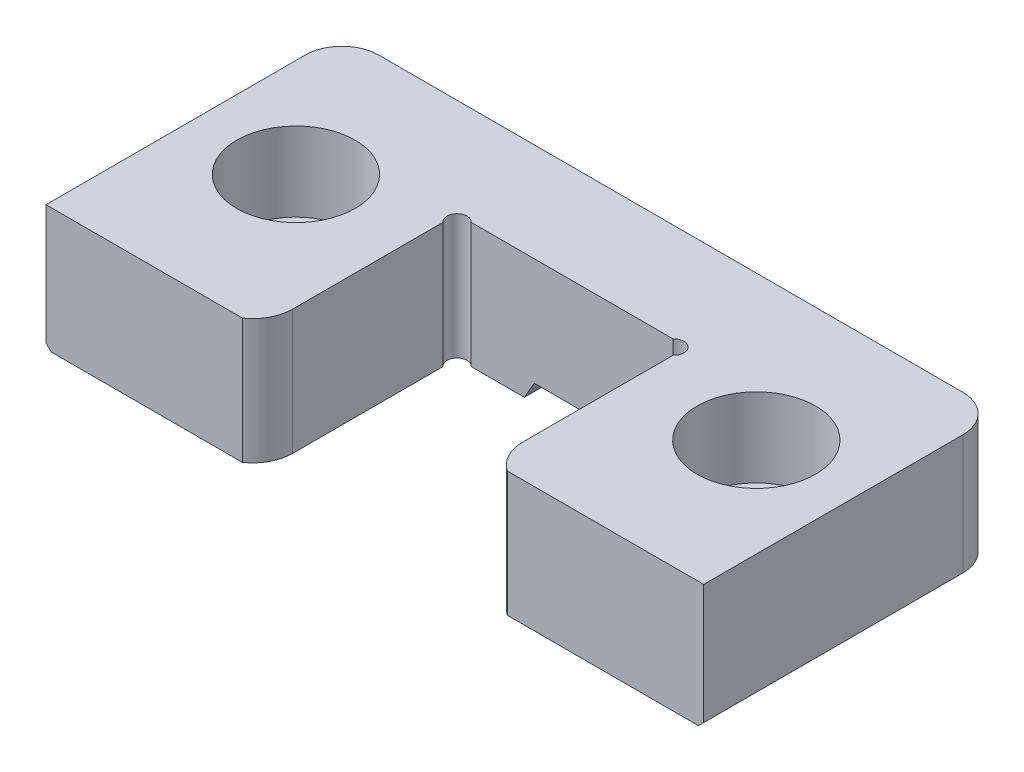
ISO-10303-21;
HEADER;
FILE_DESCRIPTION(('STEP AP214'),'2;1');
FILE_NAME('part.step','',(''),(''),'','','');
FILE_SCHEMA(('AUTOMOTIVE_DESIGN { 1 0 10303 214 1 1 1 1 }'));
ENDSEC;
DATA;
#1=APPLICATION_CONTEXT('core data for automotive mechanical design processes');
#2=APPLICATION_PROTOCOL_DEFINITION('international standard','automotive_design',2000,#1);
#3=PRODUCT_CONTEXT('',#1,'mechanical');
#4=PRODUCT('Part','Part','',(#3));
#5=PRODUCT_RELATED_PRODUCT_CATEGORY('part','',(#4));
#6=PRODUCT_DEFINITION_FORMATION('','',#4);
#7=PRODUCT_DEFINITION_CONTEXT('part definition',#1,'design');
#8=PRODUCT_DEFINITION('design','',#6,#7);
#9=PRODUCT_DEFINITION_SHAPE('','',#8);
#10=(LENGTH_UNIT() NAMED_UNIT(*) SI_UNIT(.MILLI.,.METRE.));
#11=(NAMED_UNIT(*) PLANE_ANGLE_UNIT() SI_UNIT($,.RADIAN.));
#12=(NAMED_UNIT(*) SI_UNIT($,.STERADIAN.) SOLID_ANGLE_UNIT());
#13=UNCERTAINTY_MEASURE_WITH_UNIT(LENGTH_MEASURE(1.E-05),#10,'distance_accuracy_value','');
#14=(GEOMETRIC_REPRESENTATION_CONTEXT(3) GLOBAL_UNCERTAINTY_ASSIGNED_CONTEXT((#13)) GLOBAL_UNIT_ASSIGNED_CONTEXT((#10,
#11,#12)) REPRESENTATION_CONTEXT('',''));
#15=CARTESIAN_POINT('',(0.,0.,0.));
#16=DIRECTION('',(0.,0.,1.));
#17=DIRECTION('',(1.,0.,0.));
#18=AXIS2_PLACEMENT_3D('',#15,#16,#17);
#19=CARTESIAN_POINT('',(-50.,-19.,-45.));
#20=DIRECTION('',(0.,-1.,0.));
#21=DIRECTION('',(0.,0.,-1.));
#22=AXIS2_PLACEMENT_3D('',#19,#20,#21);
#23=PLANE('',#22);
#24=CARTESIAN_POINT('',(-35.,-19.,-23.));
#25=DIRECTION('',(0.,1.,0.));
#26=DIRECTION('',(0.,0.,1.));
#27=AXIS2_PLACEMENT_3D('',#24,#25,#26);
#28=CIRCLE('',#27,5.49999999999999);
#29=CARTESIAN_POINT('',(-35.,-19.,-17.5));
#30=VERTEX_POINT('',#29);
#31=EDGE_CURVE('E203',#30,#30,#28,.T.);
#32=ORIENTED_EDGE('',*,*,#31,.T.);
#33=EDGE_LOOP('',(#32));
#34=FACE_BOUND('',#33,.T.);
#35=CARTESIAN_POINT('',(-44.4,-19.,-39.4));
#36=DIRECTION('',(0.,-1.,0.));
#37=DIRECTION('',(0.,0.,-1.));
#38=AXIS2_PLACEMENT_3D('',#35,#36,#37);
#39=CIRCLE('',#38,4.79999999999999);
#40=CARTESIAN_POINT('',(-49.2,-19.,-39.4));
#41=VERTEX_POINT('',#40);
#42=CARTESIAN_POINT('',(-44.4,-19.,-44.2));
#43=VERTEX_POINT('',#42);
#44=EDGE_CURVE('E341',#41,#43,#39,.T.);
#45=ORIENTED_EDGE('',*,*,#44,.T.);
#46=DIRECTION('',(1.,0.,0.));
#47=VECTOR('',#46,1.);
#48=CARTESIAN_POINT('',(-50.,-19.,-44.2));
#49=LINE('',#48,#47);
#50=CARTESIAN_POINT('',(-7.2679869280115,-19.,-44.2));
#51=VERTEX_POINT('',#50);
#52=EDGE_CURVE('E343',#43,#51,#49,.T.);
#53=ORIENTED_EDGE('',*,*,#52,.T.);
#54=DIRECTION('',(0.,0.,-1.));
#55=VECTOR('',#54,1.);
#56=CARTESIAN_POINT('',(-7.2679869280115,-19.,-45.));
#57=LINE('',#56,#55);
#58=CARTESIAN_POINT('',(-7.2679869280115,-19.,-30.));
#59=VERTEX_POINT('',#58);
#60=EDGE_CURVE('E325',#59,#51,#57,.T.);
#61=ORIENTED_EDGE('',*,*,#60,.F.);
#62=DIRECTION('',(1.,0.,0.));
#63=VECTOR('',#62,1.);
#64=CARTESIAN_POINT('',(-17.499,-19.,-30.));
#65=LINE('',#64,#63);
#66=CARTESIAN_POINT('',(-15.3530862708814,-19.,-30.));
#67=VERTEX_POINT('',#66);
#68=EDGE_CURVE('E275',#67,#59,#65,.T.);
#69=ORIENTED_EDGE('',*,*,#68,.F.);
#70=CARTESIAN_POINT('',(-16.489,-19.,-28.99));
#71=DIRECTION('',(0.,1.,0.));
#72=DIRECTION('',(0.,0.,1.));
#73=AXIS2_PLACEMENT_3D('',#70,#71,#72);
#74=CIRCLE('',#73,1.52);
#75=CARTESIAN_POINT('',(-17.499,-19.,-27.8540862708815));
#76=VERTEX_POINT('',#75);
#77=EDGE_CURVE('E237',#67,#76,#74,.T.);
#78=ORIENTED_EDGE('',*,*,#77,.T.);
#79=DIRECTION('',(0.,0.,-1.));
#80=VECTOR('',#79,1.);
#81=CARTESIAN_POINT('',(-17.499,-19.,0.));
#82=LINE('',#81,#80);
#83=CARTESIAN_POINT('',(-17.499,-19.,-5.));
#84=VERTEX_POINT('',#83);
#85=EDGE_CURVE('E270',#84,#76,#82,.T.);
#86=ORIENTED_EDGE('',*,*,#85,.F.);
#87=CARTESIAN_POINT('',(-23.5522036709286,-19.,-5.));
#88=DIRECTION('',(0.,-1.,0.));
#89=DIRECTION('',(0.,0.,1.));
#90=AXIS2_PLACEMENT_3D('',#87,#88,#89);
#91=CIRCLE('',#90,6.05320367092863);
#92=CARTESIAN_POINT('',(-20.1402724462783,-19.,0.));
#93=VERTEX_POINT('',#92);
#94=EDGE_CURVE('E246',#84,#93,#91,.T.);
#95=ORIENTED_EDGE('',*,*,#94,.T.);
#96=DIRECTION('',(1.,0.,0.));
#97=VECTOR('',#96,1.);
#98=CARTESIAN_POINT('',(-50.,-19.,0.));
#99=LINE('',#98,#97);
#100=CARTESIAN_POINT('',(-49.2,-19.,0.));
#101=VERTEX_POINT('',#100);
#102=EDGE_CURVE('E268',#101,#93,#99,.T.);
#103=ORIENTED_EDGE('',*,*,#102,.F.);
#104=DIRECTION('',(0.,0.,-1.));
#105=VECTOR('',#104,1.);
#106=CARTESIAN_POINT('',(-49.2,-19.,-45.));
#107=LINE('',#106,#105);
#108=EDGE_CURVE('E339',#101,#41,#107,.T.);
#109=ORIENTED_EDGE('',*,*,#108,.T.);
#110=EDGE_LOOP('',(#45,#53,#61,#69,#78,#86,#95,#103,#109));
#111=FACE_BOUND('',#110,.T.);
#112=ADVANCED_FACE('F35',(#34,#111),#23,.T.);
#113=CARTESIAN_POINT('',(-50.,-19.,0.));
#114=DIRECTION('',(-1.,0.,0.));
#115=DIRECTION('',(0.,0.,1.));
#116=AXIS2_PLACEMENT_3D('',#113,#114,#115);
#117=PLANE('',#116);
#118=DIRECTION('',(0.,1.,0.));
#119=VECTOR('',#118,1.);
#120=CARTESIAN_POINT('',(-50.,-19.,-39.4));
#121=LINE('',#120,#119);
#122=CARTESIAN_POINT('',(-50.,0.,-39.4));
#123=VERTEX_POINT('',#122);
#124=CARTESIAN_POINT('',(-50.,-18.2,-39.4));
#125=VERTEX_POINT('',#124);
#126=EDGE_CURVE('E317',#123,#125,#121,.F.);
#127=ORIENTED_EDGE('',*,*,#126,.T.);
#128=DIRECTION('',(0.,0.,1.));
#129=VECTOR('',#128,1.);
#130=CARTESIAN_POINT('',(-50.,-18.2,0.));
#131=LINE('',#130,#129);
#132=CARTESIAN_POINT('',(-50.,-18.2,0.));
#133=VERTEX_POINT('',#132);
#134=EDGE_CURVE('E348',#125,#133,#131,.T.);
#135=ORIENTED_EDGE('',*,*,#134,.T.);
#136=DIRECTION('',(0.,1.,0.));
#137=VECTOR('',#136,1.);
#138=CARTESIAN_POINT('',(-50.,-19.,0.));
#139=LINE('',#138,#137);
#140=CARTESIAN_POINT('',(-50.,0.,0.));
#141=VERTEX_POINT('',#140);
#142=EDGE_CURVE('E282',#133,#141,#139,.T.);
#143=ORIENTED_EDGE('',*,*,#142,.T.);
#144=DIRECTION('',(0.,0.,1.));
#145=VECTOR('',#144,1.);
#146=CARTESIAN_POINT('',(-50.,0.,0.));
#147=LINE('',#146,#145);
#148=EDGE_CURVE('E260',#123,#141,#147,.T.);
#149=ORIENTED_EDGE('',*,*,#148,.F.);
#150=EDGE_LOOP('',(#127,#135,#143,#149));
#151=FACE_BOUND('',#150,.T.);
#152=ADVANCED_FACE('F444',(#151),#117,.T.);
#153=CARTESIAN_POINT('',(-50.,-19.,-45.));
#154=DIRECTION('',(0.,0.,-1.));
#155=DIRECTION('',(-1.,0.,0.));
#156=AXIS2_PLACEMENT_3D('',#153,#154,#155);
#157=PLANE('',#156);
#158=DIRECTION('',(0.499999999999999,0.866025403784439,0.));
#159=VECTOR('',#158,1.);
#160=CARTESIAN_POINT('',(-6.35,-17.41,-45.));
#161=LINE('',#160,#159);
#162=CARTESIAN_POINT('',(-6.80610671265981,-18.2,-45.));
#163=VERTEX_POINT('',#162);
#164=CARTESIAN_POINT('',(-6.35,-17.41,-45.));
#165=VERTEX_POINT('',#164);
#166=EDGE_CURVE('E190',#163,#165,#161,.T.);
#167=ORIENTED_EDGE('',*,*,#166,.F.);
#168=DIRECTION('',(-1.,0.,0.));
#169=VECTOR('',#168,1.);
#170=CARTESIAN_POINT('',(-50.,-18.2,-45.));
#171=LINE('',#170,#169);
#172=CARTESIAN_POINT('',(-44.4,-18.2,-45.));
#173=VERTEX_POINT('',#172);
#174=EDGE_CURVE('E337',#163,#173,#171,.T.);
#175=ORIENTED_EDGE('',*,*,#174,.T.);
#176=DIRECTION('',(0.,1.,0.));
#177=VECTOR('',#176,1.);
#178=CARTESIAN_POINT('',(-44.4,-19.,-45.));
#179=LINE('',#178,#177);
#180=CARTESIAN_POINT('',(-44.4,0.,-45.));
#181=VERTEX_POINT('',#180);
#182=EDGE_CURVE('E312',#173,#181,#179,.T.);
#183=ORIENTED_EDGE('',*,*,#182,.T.);
#184=DIRECTION('',(-1.,0.,0.));
#185=VECTOR('',#184,1.);
#186=CARTESIAN_POINT('',(-50.,0.,-45.));
#187=LINE('',#186,#185);
#188=CARTESIAN_POINT('',(44.4,0.,-45.));
#189=VERTEX_POINT('',#188);
#190=EDGE_CURVE('E271',#189,#181,#187,.T.);
#191=ORIENTED_EDGE('',*,*,#190,.F.);
#192=DIRECTION('',(0.,1.,0.));
#193=VECTOR('',#192,1.);
#194=CARTESIAN_POINT('',(44.4,-19.,-45.));
#195=LINE('',#194,#193);
#196=CARTESIAN_POINT('',(44.4,-18.2,-45.));
#197=VERTEX_POINT('',#196);
#198=EDGE_CURVE('E314',#189,#197,#195,.F.);
#199=ORIENTED_EDGE('',*,*,#198,.T.);
#200=DIRECTION('',(-1.,0.,0.));
#201=VECTOR('',#200,1.);
#202=CARTESIAN_POINT('',(-50.,-18.2,-45.));
#203=LINE('',#202,#201);
#204=CARTESIAN_POINT('',(6.8061067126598,-18.2,-45.));
#205=VERTEX_POINT('',#204);
#206=EDGE_CURVE('E335',#197,#205,#203,.T.);
#207=ORIENTED_EDGE('',*,*,#206,.T.);
#208=DIRECTION('',(0.499999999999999,-0.866025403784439,0.));
#209=VECTOR('',#208,1.);
#210=CARTESIAN_POINT('',(6.35,-17.41,-45.));
#211=LINE('',#210,#209);
#212=CARTESIAN_POINT('',(6.35,-17.41,-45.));
#213=VERTEX_POINT('',#212);
#214=EDGE_CURVE('E214',#213,#205,#211,.T.);
#215=ORIENTED_EDGE('',*,*,#214,.F.);
#216=DIRECTION('',(1.,0.,0.));
#217=VECTOR('',#216,1.);
#218=CARTESIAN_POINT('',(6.35,-17.41,-45.));
#219=LINE('',#218,#217);
#220=EDGE_CURVE('E202',#165,#213,#219,.T.);
#221=ORIENTED_EDGE('',*,*,#220,.F.);
#222=EDGE_LOOP('',(#167,#175,#183,#191,#199,#207,#215,#221));
#223=FACE_BOUND('',#222,.T.);
#224=ADVANCED_FACE('F216',(#223),#157,.T.);
#225=CARTESIAN_POINT('',(50.,-19.,0.));
#226=DIRECTION('',(1.,0.,0.));
#227=DIRECTION('',(0.,0.,-1.));
#228=AXIS2_PLACEMENT_3D('',#225,#226,#227);
#229=PLANE('',#228);
#230=DIRECTION('',(0.,1.,0.));
#231=VECTOR('',#230,1.);
#232=CARTESIAN_POINT('',(50.,-19.,0.));
#233=LINE('',#232,#231);
#234=CARTESIAN_POINT('',(50.,-18.2,0.));
#235=VERTEX_POINT('',#234);
#236=CARTESIAN_POINT('',(50.,0.,0.));
#237=VERTEX_POINT('',#236);
#238=EDGE_CURVE('E303',#235,#237,#233,.T.);
#239=ORIENTED_EDGE('',*,*,#238,.F.);
#240=DIRECTION('',(0.,0.,-1.));
#241=VECTOR('',#240,1.);
#242=CARTESIAN_POINT('',(50.,-18.2,0.));
#243=LINE('',#242,#241);
#244=CARTESIAN_POINT('',(50.,-18.2,-39.4));
#245=VERTEX_POINT('',#244);
#246=EDGE_CURVE('E44',#235,#245,#243,.T.);
#247=ORIENTED_EDGE('',*,*,#246,.T.);
#248=DIRECTION('',(0.,1.,0.));
#249=VECTOR('',#248,1.);
#250=CARTESIAN_POINT('',(50.,-19.,-39.4));
#251=LINE('',#250,#249);
#252=CARTESIAN_POINT('',(50.,0.,-39.4));
#253=VERTEX_POINT('',#252);
#254=EDGE_CURVE('E305',#245,#253,#251,.T.);
#255=ORIENTED_EDGE('',*,*,#254,.T.);
#256=DIRECTION('',(0.,0.,-1.));
#257=VECTOR('',#256,1.);
#258=CARTESIAN_POINT('',(50.,0.,0.));
#259=LINE('',#258,#257);
#260=EDGE_CURVE('E298',#237,#253,#259,.T.);
#261=ORIENTED_EDGE('',*,*,#260,.F.);
#262=EDGE_LOOP('',(#239,#247,#255,#261));
#263=FACE_BOUND('',#262,.T.);
#264=ADVANCED_FACE('F436',(#263),#229,.T.);
#265=CARTESIAN_POINT('',(17.499,-19.,0.));
#266=DIRECTION('',(0.,0.,1.));
#267=DIRECTION('',(1.,0.,0.));
#268=AXIS2_PLACEMENT_3D('',#265,#266,#267);
#269=PLANE('',#268);
#270=DIRECTION('',(1.,0.,0.));
#271=VECTOR('',#270,1.);
#272=CARTESIAN_POINT('',(17.499,-19.,0.));
#273=LINE('',#272,#271);
#274=CARTESIAN_POINT('',(20.1402724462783,-19.,0.));
#275=VERTEX_POINT('',#274);
#276=CARTESIAN_POINT('',(49.2,-19.,0.));
#277=VERTEX_POINT('',#276);
#278=EDGE_CURVE('E280',#275,#277,#273,.T.);
#279=ORIENTED_EDGE('',*,*,#278,.T.);
#280=DIRECTION('',(-0.707106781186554,-0.707106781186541,0.));
#281=VECTOR('',#280,1.);
#282=CARTESIAN_POINT('',(33.3494999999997,-34.8505,0.));
#283=LINE('',#282,#281);
#284=EDGE_CURVE('E11',#277,#235,#283,.F.);
#285=ORIENTED_EDGE('',*,*,#284,.T.);
#286=ORIENTED_EDGE('',*,*,#238,.T.);
#287=DIRECTION('',(1.,0.,0.));
#288=VECTOR('',#287,1.);
#289=CARTESIAN_POINT('',(17.499,0.,0.));
#290=LINE('',#289,#288);
#291=CARTESIAN_POINT('',(20.1402724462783,0.,0.));
#292=VERTEX_POINT('',#291);
#293=EDGE_CURVE('E295',#292,#237,#290,.T.);
#294=ORIENTED_EDGE('',*,*,#293,.F.);
#295=DIRECTION('',(0.,1.,0.));
#296=VECTOR('',#295,1.);
#297=CARTESIAN_POINT('',(20.1402724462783,-19.,0.));
#298=LINE('',#297,#296);
#299=EDGE_CURVE('E264',#275,#292,#298,.T.);
#300=ORIENTED_EDGE('',*,*,#299,.F.);
#301=EDGE_LOOP('',(#279,#285,#286,#294,#300));
#302=FACE_BOUND('',#301,.T.);
#303=ADVANCED_FACE('F387',(#302),#269,.T.);
#304=CARTESIAN_POINT('',(17.499,-19.,0.));
#305=DIRECTION('',(-1.,0.,0.));
#306=DIRECTION('',(0.,0.,1.));
#307=AXIS2_PLACEMENT_3D('',#304,#305,#306);
#308=PLANE('',#307);
#309=DIRECTION('',(0.,1.,0.));
#310=VECTOR('',#309,1.);
#311=CARTESIAN_POINT('',(17.499,-19.,-27.8540862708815));
#312=LINE('',#311,#310);
#313=CARTESIAN_POINT('',(17.499,-19.,-27.8540862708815));
#314=VERTEX_POINT('',#313);
#315=CARTESIAN_POINT('',(17.499,0.,-27.8540862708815));
#316=VERTEX_POINT('',#315);
#317=EDGE_CURVE('E234',#314,#316,#312,.T.);
#318=ORIENTED_EDGE('',*,*,#317,.F.);
#319=DIRECTION('',(0.,0.,1.));
#320=VECTOR('',#319,1.);
#321=CARTESIAN_POINT('',(17.499,-19.,0.));
#322=LINE('',#321,#320);
#323=CARTESIAN_POINT('',(17.499,-19.,-5.));
#324=VERTEX_POINT('',#323);
#325=EDGE_CURVE('E278',#314,#324,#322,.T.);
#326=ORIENTED_EDGE('',*,*,#325,.T.);
#327=DIRECTION('',(0.,1.,0.));
#328=VECTOR('',#327,1.);
#329=CARTESIAN_POINT('',(17.499,-19.,-5.));
#330=LINE('',#329,#328);
#331=CARTESIAN_POINT('',(17.499,0.,-5.));
#332=VERTEX_POINT('',#331);
#333=EDGE_CURVE('E261',#324,#332,#330,.T.);
#334=ORIENTED_EDGE('',*,*,#333,.T.);
#335=DIRECTION('',(0.,0.,1.));
#336=VECTOR('',#335,1.);
#337=CARTESIAN_POINT('',(17.499,0.,0.));
#338=LINE('',#337,#336);
#339=EDGE_CURVE('E293',#316,#332,#338,.T.);
#340=ORIENTED_EDGE('',*,*,#339,.F.);
#341=EDGE_LOOP('',(#318,#326,#334,#340));
#342=FACE_BOUND('',#341,.T.);
#343=ADVANCED_FACE('F399',(#342),#308,.T.);
#344=CARTESIAN_POINT('',(-17.499,-19.,-30.));
#345=DIRECTION('',(0.,0.,1.));
#346=DIRECTION('',(1.,0.,0.));
#347=AXIS2_PLACEMENT_3D('',#344,#345,#346);
#348=PLANE('',#347);
#349=DIRECTION('',(-0.499999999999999,-0.86602540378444,0.));
#350=VECTOR('',#349,1.);
#351=CARTESIAN_POINT('',(-9.82574019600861,-23.4301586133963,-30.));
#352=LINE('',#351,#350);
#353=CARTESIAN_POINT('',(-5.76213795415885,-16.3917930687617,-30.));
#354=VERTEX_POINT('',#353);
#355=EDGE_CURVE('E226',#354,#59,#352,.T.);
#356=ORIENTED_EDGE('',*,*,#355,.F.);
#357=DIRECTION('',(1.,0.,0.));
#358=VECTOR('',#357,1.);
#359=CARTESIAN_POINT('',(6.35,-16.3917930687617,-30.));
#360=LINE('',#359,#358);
#361=CARTESIAN_POINT('',(5.76213795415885,-16.3917930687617,-30.));
#362=VERTEX_POINT('',#361);
#363=EDGE_CURVE('E328',#354,#362,#360,.T.);
#364=ORIENTED_EDGE('',*,*,#363,.T.);
#365=DIRECTION('',(-0.499999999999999,0.86602540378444,0.));
#366=VECTOR('',#365,1.);
#367=CARTESIAN_POINT('',(1.07624019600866,-8.27558007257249,-30.));
#368=LINE('',#367,#366);
#369=CARTESIAN_POINT('',(7.2679869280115,-19.,-30.));
#370=VERTEX_POINT('',#369);
#371=EDGE_CURVE('E223',#370,#362,#368,.T.);
#372=ORIENTED_EDGE('',*,*,#371,.F.);
#373=CARTESIAN_POINT('',(15.3530862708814,-19.,-30.));
#374=VERTEX_POINT('',#373);
#375=EDGE_CURVE('E274',#370,#374,#65,.T.);
#376=ORIENTED_EDGE('',*,*,#375,.T.);
#377=DIRECTION('',(0.,1.,0.));
#378=VECTOR('',#377,1.);
#379=CARTESIAN_POINT('',(15.3530862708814,-19.,-30.));
#380=LINE('',#379,#378);
#381=CARTESIAN_POINT('',(15.3530862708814,0.,-30.));
#382=VERTEX_POINT('',#381);
#383=EDGE_CURVE('E231',#382,#374,#380,.F.);
#384=ORIENTED_EDGE('',*,*,#383,.F.);
#385=DIRECTION('',(1.,0.,0.));
#386=VECTOR('',#385,1.);
#387=CARTESIAN_POINT('',(-17.499,0.,-30.));
#388=LINE('',#387,#386);
#389=CARTESIAN_POINT('',(-15.3530862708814,0.,-30.));
#390=VERTEX_POINT('',#389);
#391=EDGE_CURVE('E290',#390,#382,#388,.T.);
#392=ORIENTED_EDGE('',*,*,#391,.F.);
#393=DIRECTION('',(0.,1.,0.));
#394=VECTOR('',#393,1.);
#395=CARTESIAN_POINT('',(-15.3530862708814,-19.,-30.));
#396=LINE('',#395,#394);
#397=EDGE_CURVE('E243',#67,#390,#396,.T.);
#398=ORIENTED_EDGE('',*,*,#397,.F.);
#399=ORIENTED_EDGE('',*,*,#68,.T.);
#400=EDGE_LOOP('',(#356,#364,#372,#376,#384,#392,#398,#399));
#401=FACE_BOUND('',#400,.T.);
#402=ADVANCED_FACE('F407',(#401),#348,.T.);
#403=CARTESIAN_POINT('',(-17.499,-19.,0.));
#404=DIRECTION('',(1.,0.,0.));
#405=DIRECTION('',(0.,0.,-1.));
#406=AXIS2_PLACEMENT_3D('',#403,#404,#405);
#407=PLANE('',#406);
#408=DIRECTION('',(0.,1.,0.));
#409=VECTOR('',#408,1.);
#410=CARTESIAN_POINT('',(-17.499,-19.,-27.8540862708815));
#411=LINE('',#410,#409);
#412=CARTESIAN_POINT('',(-17.499,0.,-27.8540862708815));
#413=VERTEX_POINT('',#412);
#414=EDGE_CURVE('E240',#413,#76,#411,.F.);
#415=ORIENTED_EDGE('',*,*,#414,.F.);
#416=DIRECTION('',(0.,0.,-1.));
#417=VECTOR('',#416,1.);
#418=CARTESIAN_POINT('',(-17.499,0.,0.));
#419=LINE('',#418,#417);
#420=CARTESIAN_POINT('',(-17.499,0.,-5.));
#421=VERTEX_POINT('',#420);
#422=EDGE_CURVE('E287',#421,#413,#419,.T.);
#423=ORIENTED_EDGE('',*,*,#422,.F.);
#424=DIRECTION('',(0.,1.,0.));
#425=VECTOR('',#424,1.);
#426=CARTESIAN_POINT('',(-17.499,-19.,-5.));
#427=LINE('',#426,#425);
#428=EDGE_CURVE('E258',#84,#421,#427,.T.);
#429=ORIENTED_EDGE('',*,*,#428,.F.);
#430=ORIENTED_EDGE('',*,*,#85,.T.);
#431=EDGE_LOOP('',(#415,#423,#429,#430));
#432=FACE_BOUND('',#431,.T.);
#433=ADVANCED_FACE('F417',(#432),#407,.T.);
#434=CARTESIAN_POINT('',(-50.,-19.,0.));
#435=DIRECTION('',(0.,0.,1.));
#436=DIRECTION('',(1.,0.,0.));
#437=AXIS2_PLACEMENT_3D('',#434,#435,#436);
#438=PLANE('',#437);
#439=ORIENTED_EDGE('',*,*,#142,.F.);
#440=DIRECTION('',(-0.707106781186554,0.707106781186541,0.));
#441=VECTOR('',#440,1.);
#442=CARTESIAN_POINT('',(-49.6,-18.6,0.));
#443=LINE('',#442,#441);
#444=EDGE_CURVE('E350',#133,#101,#443,.F.);
#445=ORIENTED_EDGE('',*,*,#444,.T.);
#446=ORIENTED_EDGE('',*,*,#102,.T.);
#447=DIRECTION('',(0.,1.,0.));
#448=VECTOR('',#447,1.);
#449=CARTESIAN_POINT('',(-20.1402724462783,-19.,0.));
#450=LINE('',#449,#448);
#451=CARTESIAN_POINT('',(-20.1402724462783,0.,0.));
#452=VERTEX_POINT('',#451);
#453=EDGE_CURVE('E253',#93,#452,#450,.T.);
#454=ORIENTED_EDGE('',*,*,#453,.T.);
#455=DIRECTION('',(1.,0.,0.));
#456=VECTOR('',#455,1.);
#457=CARTESIAN_POINT('',(-50.,0.,0.));
#458=LINE('',#457,#456);
#459=EDGE_CURVE('E285',#141,#452,#458,.T.);
#460=ORIENTED_EDGE('',*,*,#459,.F.);
#461=EDGE_LOOP('',(#439,#445,#446,#454,#460));
#462=FACE_BOUND('',#461,.T.);
#463=ADVANCED_FACE('F462',(#462),#438,.T.);
#464=CARTESIAN_POINT('',(35.,-19.,-23.));
#465=DIRECTION('',(0.,1.,0.));
#466=DIRECTION('',(0.,0.,1.));
#467=AXIS2_PLACEMENT_3D('',#464,#465,#466);
#468=CIRCLE('',#467,5.49999999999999);
#469=CARTESIAN_POINT('',(35.,-19.,-17.5));
#470=VERTEX_POINT('',#469);
#471=EDGE_CURVE('E493',#470,#470,#468,.T.);
#472=ORIENTED_EDGE('',*,*,#471,.T.);
#473=EDGE_LOOP('',(#472));
#474=FACE_BOUND('',#473,.T.);
#475=DIRECTION('',(0.,0.,1.));
#476=VECTOR('',#475,1.);
#477=CARTESIAN_POINT('',(7.2679869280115,-19.,-45.));
#478=LINE('',#477,#476);
#479=CARTESIAN_POINT('',(7.2679869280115,-19.,-44.2));
#480=VERTEX_POINT('',#479);
#481=EDGE_CURVE('E323',#480,#370,#478,.T.);
#482=ORIENTED_EDGE('',*,*,#481,.F.);
#483=DIRECTION('',(1.,0.,0.));
#484=VECTOR('',#483,1.);
#485=CARTESIAN_POINT('',(-50.,-19.,-44.2));
#486=LINE('',#485,#484);
#487=CARTESIAN_POINT('',(44.4,-19.,-44.2));
#488=VERTEX_POINT('',#487);
#489=EDGE_CURVE('E358',#480,#488,#486,.T.);
#490=ORIENTED_EDGE('',*,*,#489,.T.);
#491=CARTESIAN_POINT('',(44.4,-19.,-39.4));
#492=DIRECTION('',(0.,-1.,0.));
#493=DIRECTION('',(0.,0.,-1.));
#494=AXIS2_PLACEMENT_3D('',#491,#492,#493);
#495=CIRCLE('',#494,4.79999999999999);
#496=CARTESIAN_POINT('',(49.2,-19.,-39.4));
#497=VERTEX_POINT('',#496);
#498=EDGE_CURVE('E356',#488,#497,#495,.T.);
#499=ORIENTED_EDGE('',*,*,#498,.T.);
#500=DIRECTION('',(0.,0.,1.));
#501=VECTOR('',#500,1.);
#502=CARTESIAN_POINT('',(49.2,-19.,-45.));
#503=LINE('',#502,#501);
#504=EDGE_CURVE('E354',#497,#277,#503,.T.);
#505=ORIENTED_EDGE('',*,*,#504,.T.);
#506=ORIENTED_EDGE('',*,*,#278,.F.);
#507=CARTESIAN_POINT('',(23.5522036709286,-19.,-5.));
#508=DIRECTION('',(0.,-1.,0.));
#509=DIRECTION('',(0.,0.,-1.));
#510=AXIS2_PLACEMENT_3D('',#507,#508,#509);
#511=CIRCLE('',#510,6.05320367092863);
#512=EDGE_CURVE('E249',#275,#324,#511,.T.);
#513=ORIENTED_EDGE('',*,*,#512,.T.);
#514=ORIENTED_EDGE('',*,*,#325,.F.);
#515=CARTESIAN_POINT('',(16.489,-19.,-28.99));
#516=DIRECTION('',(0.,1.,0.));
#517=DIRECTION('',(0.,0.,-1.));
#518=AXIS2_PLACEMENT_3D('',#515,#516,#517);
#519=CIRCLE('',#518,1.52);
#520=EDGE_CURVE('E228',#314,#374,#519,.T.);
#521=ORIENTED_EDGE('',*,*,#520,.T.);
#522=ORIENTED_EDGE('',*,*,#375,.F.);
#523=EDGE_LOOP('',(#482,#490,#499,#505,#506,#513,#514,#521,#522));
#524=FACE_BOUND('',#523,.T.);
#525=ADVANCED_FACE('F385',(#474,#524),#23,.T.);
#526=CARTESIAN_POINT('',(-50.,0.,-45.));
#527=DIRECTION('',(0.,-1.,0.));
#528=DIRECTION('',(0.,0.,-1.));
#529=AXIS2_PLACEMENT_3D('',#526,#527,#528);
#530=PLANE('',#529);
#531=CARTESIAN_POINT('',(35.,0.,-23.));
#532=DIRECTION('',(0.,1.,0.));
#533=DIRECTION('',(0.,0.,1.));
#534=AXIS2_PLACEMENT_3D('',#531,#532,#533);
#535=CIRCLE('',#534,9.);
#536=CARTESIAN_POINT('',(35.,0.,-14.));
#537=VERTEX_POINT('',#536);
#538=EDGE_CURVE('E367',#537,#537,#535,.T.);
#539=ORIENTED_EDGE('',*,*,#538,.F.);
#540=EDGE_LOOP('',(#539));
#541=FACE_BOUND('',#540,.T.);
#542=CARTESIAN_POINT('',(-35.,0.,-23.));
#543=DIRECTION('',(0.,1.,0.));
#544=DIRECTION('',(0.,0.,1.));
#545=AXIS2_PLACEMENT_3D('',#542,#543,#544);
#546=CIRCLE('',#545,9.);
#547=CARTESIAN_POINT('',(-35.,0.,-14.));
#548=VERTEX_POINT('',#547);
#549=EDGE_CURVE('E495',#548,#548,#546,.T.);
#550=ORIENTED_EDGE('',*,*,#549,.F.);
#551=EDGE_LOOP('',(#550));
#552=FACE_BOUND('',#551,.T.);
#553=ORIENTED_EDGE('',*,*,#391,.T.);
#554=CARTESIAN_POINT('',(16.489,0.,-28.99));
#555=DIRECTION('',(0.,-1.,0.));
#556=DIRECTION('',(0.,0.,-1.));
#557=AXIS2_PLACEMENT_3D('',#554,#555,#556);
#558=CIRCLE('',#557,1.52);
#559=EDGE_CURVE('E320',#382,#316,#558,.T.);
#560=ORIENTED_EDGE('',*,*,#559,.T.);
#561=ORIENTED_EDGE('',*,*,#339,.T.);
#562=CARTESIAN_POINT('',(23.5522036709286,0.,-5.));
#563=DIRECTION('',(0.,-1.,0.));
#564=DIRECTION('',(0.,0.,-1.));
#565=AXIS2_PLACEMENT_3D('',#562,#563,#564);
#566=CIRCLE('',#565,6.05320367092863);
#567=EDGE_CURVE('E250',#292,#332,#566,.T.);
#568=ORIENTED_EDGE('',*,*,#567,.F.);
#569=ORIENTED_EDGE('',*,*,#293,.T.);
#570=ORIENTED_EDGE('',*,*,#260,.T.);
#571=CARTESIAN_POINT('',(44.4,0.,-39.4));
#572=DIRECTION('',(0.,-1.,0.));
#573=DIRECTION('',(0.,0.,-1.));
#574=AXIS2_PLACEMENT_3D('',#571,#572,#573);
#575=CIRCLE('',#574,5.6);
#576=EDGE_CURVE('E310',#253,#189,#575,.F.);
#577=ORIENTED_EDGE('',*,*,#576,.T.);
#578=ORIENTED_EDGE('',*,*,#190,.T.);
#579=CARTESIAN_POINT('',(-44.4,0.,-39.4));
#580=DIRECTION('',(0.,-1.,0.));
#581=DIRECTION('',(0.,0.,-1.));
#582=AXIS2_PLACEMENT_3D('',#579,#580,#581);
#583=CIRCLE('',#582,5.6);
#584=EDGE_CURVE('E308',#181,#123,#583,.F.);
#585=ORIENTED_EDGE('',*,*,#584,.T.);
#586=ORIENTED_EDGE('',*,*,#148,.T.);
#587=ORIENTED_EDGE('',*,*,#459,.T.);
#588=CARTESIAN_POINT('',(-23.5522036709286,0.,-5.));
#589=DIRECTION('',(0.,-1.,0.));
#590=DIRECTION('',(0.,0.,1.));
#591=AXIS2_PLACEMENT_3D('',#588,#589,#590);
#592=CIRCLE('',#591,6.05320367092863);
#593=EDGE_CURVE('E245',#421,#452,#592,.T.);
#594=ORIENTED_EDGE('',*,*,#593,.F.);
#595=ORIENTED_EDGE('',*,*,#422,.T.);
#596=CARTESIAN_POINT('',(-16.489,0.,-28.99));
#597=DIRECTION('',(0.,1.,0.));
#598=DIRECTION('',(0.,0.,1.));
#599=AXIS2_PLACEMENT_3D('',#596,#597,#598);
#600=CIRCLE('',#599,1.52);
#601=EDGE_CURVE('E236',#390,#413,#600,.T.);
#602=ORIENTED_EDGE('',*,*,#601,.F.);
#603=EDGE_LOOP('',(#553,#560,#561,#568,#569,#570,#577,#578,#585,#586,#587,#594,#595,#602));
#604=FACE_BOUND('',#603,.T.);
#605=ADVANCED_FACE('F394',(#541,#552,#604),#530,.F.);
#606=CARTESIAN_POINT('',(44.4,-19.,-39.4));
#607=DIRECTION('',(0.,1.,0.));
#608=DIRECTION('',(0.,0.,1.));
#609=AXIS2_PLACEMENT_3D('',#606,#607,#608);
#610=CYLINDRICAL_SURFACE('',#609,5.6);
#611=ORIENTED_EDGE('',*,*,#254,.F.);
#612=CARTESIAN_POINT('',(44.4,-18.2,-39.4));
#613=DIRECTION('',(0.,-1.,0.));
#614=DIRECTION('',(0.,0.,-1.));
#615=AXIS2_PLACEMENT_3D('',#612,#613,#614);
#616=CIRCLE('',#615,5.6);
#617=EDGE_CURVE('E360',#245,#197,#616,.F.);
#618=ORIENTED_EDGE('',*,*,#617,.T.);
#619=ORIENTED_EDGE('',*,*,#198,.F.);
#620=ORIENTED_EDGE('',*,*,#576,.F.);
#621=EDGE_LOOP('',(#611,#618,#619,#620));
#622=FACE_BOUND('',#621,.T.);
#623=ADVANCED_FACE('F435',(#622),#610,.T.);
#624=CARTESIAN_POINT('',(-44.4,-19.,-39.4));
#625=DIRECTION('',(0.,1.,0.));
#626=DIRECTION('',(0.,0.,1.));
#627=AXIS2_PLACEMENT_3D('',#624,#625,#626);
#628=CYLINDRICAL_SURFACE('',#627,5.6);
#629=ORIENTED_EDGE('',*,*,#182,.F.);
#630=CARTESIAN_POINT('',(-44.4,-18.2,-39.4));
#631=DIRECTION('',(0.,-1.,0.));
#632=DIRECTION('',(0.,0.,-1.));
#633=AXIS2_PLACEMENT_3D('',#630,#631,#632);
#634=CIRCLE('',#633,5.6);
#635=EDGE_CURVE('E346',#173,#125,#634,.F.);
#636=ORIENTED_EDGE('',*,*,#635,.T.);
#637=ORIENTED_EDGE('',*,*,#126,.F.);
#638=ORIENTED_EDGE('',*,*,#584,.F.);
#639=EDGE_LOOP('',(#629,#636,#637,#638));
#640=FACE_BOUND('',#639,.T.);
#641=ADVANCED_FACE('F447',(#640),#628,.T.);
#642=CARTESIAN_POINT('',(23.5522036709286,-19.,-5.));
#643=DIRECTION('',(0.,1.,0.));
#644=DIRECTION('',(0.,0.,1.));
#645=AXIS2_PLACEMENT_3D('',#642,#643,#644);
#646=CYLINDRICAL_SURFACE('',#645,6.05320367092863);
#647=ORIENTED_EDGE('',*,*,#567,.T.);
#648=ORIENTED_EDGE('',*,*,#333,.F.);
#649=ORIENTED_EDGE('',*,*,#512,.F.);
#650=ORIENTED_EDGE('',*,*,#299,.T.);
#651=EDGE_LOOP('',(#647,#648,#649,#650));
#652=FACE_BOUND('',#651,.T.);
#653=ADVANCED_FACE('F391',(#652),#646,.T.);
#654=CARTESIAN_POINT('',(-23.5522036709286,-19.,-5.));
#655=DIRECTION('',(0.,1.,0.));
#656=DIRECTION('',(0.,0.,1.));
#657=AXIS2_PLACEMENT_3D('',#654,#655,#656);
#658=CYLINDRICAL_SURFACE('',#657,6.05320367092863);
#659=ORIENTED_EDGE('',*,*,#593,.T.);
#660=ORIENTED_EDGE('',*,*,#453,.F.);
#661=ORIENTED_EDGE('',*,*,#94,.F.);
#662=ORIENTED_EDGE('',*,*,#428,.T.);
#663=EDGE_LOOP('',(#659,#660,#661,#662));
#664=FACE_BOUND('',#663,.T.);
#665=ADVANCED_FACE('F465',(#664),#658,.T.);
#666=CARTESIAN_POINT('',(-16.489,-19.,-28.99));
#667=DIRECTION('',(0.,1.,0.));
#668=DIRECTION('',(0.,0.,1.));
#669=AXIS2_PLACEMENT_3D('',#666,#667,#668);
#670=CYLINDRICAL_SURFACE('',#669,1.52);
#671=ORIENTED_EDGE('',*,*,#397,.T.);
#672=ORIENTED_EDGE('',*,*,#601,.T.);
#673=ORIENTED_EDGE('',*,*,#414,.T.);
#674=ORIENTED_EDGE('',*,*,#77,.F.);
#675=EDGE_LOOP('',(#671,#672,#673,#674));
#676=FACE_BOUND('',#675,.T.);
#677=ADVANCED_FACE('F415',(#676),#670,.F.);
#678=CARTESIAN_POINT('',(16.489,-19.,-28.99));
#679=DIRECTION('',(0.,1.,0.));
#680=DIRECTION('',(0.,0.,1.));
#681=AXIS2_PLACEMENT_3D('',#678,#679,#680);
#682=CYLINDRICAL_SURFACE('',#681,1.52);
#683=ORIENTED_EDGE('',*,*,#317,.T.);
#684=ORIENTED_EDGE('',*,*,#559,.F.);
#685=ORIENTED_EDGE('',*,*,#383,.T.);
#686=ORIENTED_EDGE('',*,*,#520,.F.);
#687=EDGE_LOOP('',(#683,#684,#685,#686));
#688=FACE_BOUND('',#687,.T.);
#689=ADVANCED_FACE('F403',(#688),#682,.F.);
#690=CARTESIAN_POINT('',(-6.35,-17.41,0.));
#691=DIRECTION('',(-0.866025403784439,0.499999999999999,0.));
#692=DIRECTION('',(-0.499999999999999,-0.86602540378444,0.));
#693=AXIS2_PLACEMENT_3D('',#690,#691,#692);
#694=PLANE('',#693);
#695=ORIENTED_EDGE('',*,*,#60,.T.);
#696=DIRECTION('',(-0.377964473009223,-0.654653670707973,0.654653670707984));
#697=VECTOR('',#696,1.);
#698=CARTESIAN_POINT('',(-12.9766628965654,-28.8877168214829,-34.3122831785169));
#699=LINE('',#698,#697);
#700=EDGE_CURVE('E197',#51,#163,#699,.F.);
#701=ORIENTED_EDGE('',*,*,#700,.T.);
#702=ORIENTED_EDGE('',*,*,#166,.T.);
#703=DIRECTION('',(0.,0.,-1.));
#704=VECTOR('',#703,1.);
#705=CARTESIAN_POINT('',(-6.35,-17.41,0.));
#706=LINE('',#705,#704);
#707=CARTESIAN_POINT('',(-6.35,-17.41,-33.8));
#708=VERTEX_POINT('',#707);
#709=EDGE_CURVE('E195',#708,#165,#706,.T.);
#710=ORIENTED_EDGE('',*,*,#709,.F.);
#711=DIRECTION('',(0.147788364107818,0.25597695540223,0.955319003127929));
#712=VECTOR('',#711,1.);
#713=CARTESIAN_POINT('',(-1.57794589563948,-9.14455983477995,-2.95295735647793));
#714=LINE('',#713,#712);
#715=EDGE_CURVE('E331',#708,#354,#714,.T.);
#716=ORIENTED_EDGE('',*,*,#715,.T.);
#717=ORIENTED_EDGE('',*,*,#355,.T.);
#718=EDGE_LOOP('',(#695,#701,#702,#710,#716,#717));
#719=FACE_BOUND('',#718,.T.);
#720=ADVANCED_FACE('F193',(#719),#694,.F.);
#721=CARTESIAN_POINT('',(6.35,-17.41,0.));
#722=DIRECTION('',(0.866025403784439,0.499999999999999,0.));
#723=DIRECTION('',(-0.499999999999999,0.86602540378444,0.));
#724=AXIS2_PLACEMENT_3D('',#721,#722,#723);
#725=PLANE('',#724);
#726=ORIENTED_EDGE('',*,*,#214,.T.);
#727=DIRECTION('',(-0.377964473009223,0.654653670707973,-0.654653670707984));
#728=VECTOR('',#727,1.);
#729=CARTESIAN_POINT('',(-1.30905138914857,-4.14413385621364,-59.0558661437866));
#730=LINE('',#729,#728);
#731=EDGE_CURVE('E352',#205,#480,#730,.F.);
#732=ORIENTED_EDGE('',*,*,#731,.T.);
#733=ORIENTED_EDGE('',*,*,#481,.T.);
#734=ORIENTED_EDGE('',*,*,#371,.T.);
#735=DIRECTION('',(0.147788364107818,-0.25597695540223,-0.955319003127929));
#736=VECTOR('',#735,1.);
#737=CARTESIAN_POINT('',(1.57794589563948,-9.14455983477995,-2.95295735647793));
#738=LINE('',#737,#736);
#739=CARTESIAN_POINT('',(6.35,-17.41,-33.8));
#740=VERTEX_POINT('',#739);
#741=EDGE_CURVE('E333',#362,#740,#738,.T.);
#742=ORIENTED_EDGE('',*,*,#741,.T.);
#743=DIRECTION('',(0.,0.,-1.));
#744=VECTOR('',#743,1.);
#745=CARTESIAN_POINT('',(6.35,-17.41,0.));
#746=LINE('',#745,#744);
#747=EDGE_CURVE('E213',#740,#213,#746,.T.);
#748=ORIENTED_EDGE('',*,*,#747,.T.);
#749=EDGE_LOOP('',(#726,#732,#733,#734,#742,#748));
#750=FACE_BOUND('',#749,.T.);
#751=ADVANCED_FACE('F429',(#750),#725,.F.);
#752=CARTESIAN_POINT('',(6.35,-17.41,0.));
#753=DIRECTION('',(0.,1.,0.));
#754=DIRECTION('',(0.,0.,1.));
#755=AXIS2_PLACEMENT_3D('',#752,#753,#754);
#756=PLANE('',#755);
#757=ORIENTED_EDGE('',*,*,#747,.F.);
#758=DIRECTION('',(-1.,0.,0.));
#759=VECTOR('',#758,1.);
#760=CARTESIAN_POINT('',(-6.35,-17.41,-33.8));
#761=LINE('',#760,#759);
#762=EDGE_CURVE('E212',#740,#708,#761,.T.);
#763=ORIENTED_EDGE('',*,*,#762,.T.);
#764=ORIENTED_EDGE('',*,*,#709,.T.);
#765=ORIENTED_EDGE('',*,*,#220,.T.);
#766=EDGE_LOOP('',(#757,#763,#764,#765));
#767=FACE_BOUND('',#766,.T.);
#768=ADVANCED_FACE('F209',(#767),#756,.F.);
#769=CARTESIAN_POINT('',(6.35,-17.41,-33.8));
#770=DIRECTION('',(0.,-0.965925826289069,0.258819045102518));
#771=DIRECTION('',(0.,-0.258819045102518,-0.965925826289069));
#772=AXIS2_PLACEMENT_3D('',#769,#770,#771);
#773=PLANE('',#772);
#774=ORIENTED_EDGE('',*,*,#741,.F.);
#775=ORIENTED_EDGE('',*,*,#363,.F.);
#776=ORIENTED_EDGE('',*,*,#715,.F.);
#777=ORIENTED_EDGE('',*,*,#762,.F.);
#778=EDGE_LOOP('',(#774,#775,#776,#777));
#779=FACE_BOUND('',#778,.T.);
#780=ADVANCED_FACE('F427',(#779),#773,.T.);
#781=CARTESIAN_POINT('',(-35.,0.,-23.));
#782=DIRECTION('',(0.,1.,0.));
#783=DIRECTION('',(0.,0.,1.));
#784=AXIS2_PLACEMENT_3D('',#781,#782,#783);
#785=CYLINDRICAL_SURFACE('',#784,5.5);
#786=ORIENTED_EDGE('',*,*,#31,.F.);
#787=EDGE_LOOP('',(#786));
#788=FACE_BOUND('',#787,.T.);
#789=CARTESIAN_POINT('',(-35.,-12.,-23.));
#790=DIRECTION('',(0.,1.,0.));
#791=DIRECTION('',(0.,0.,1.));
#792=AXIS2_PLACEMENT_3D('',#789,#790,#791);
#793=CIRCLE('',#792,5.5);
#794=CARTESIAN_POINT('',(-35.,-12.,-17.5));
#795=VERTEX_POINT('',#794);
#796=EDGE_CURVE('E508',#795,#795,#793,.T.);
#797=ORIENTED_EDGE('',*,*,#796,.T.);
#798=EDGE_LOOP('',(#797));
#799=FACE_BOUND('',#798,.T.);
#800=ADVANCED_FACE('F512',(#788,#799),#785,.F.);
#801=CARTESIAN_POINT('',(-29.5,-12.,-23.));
#802=DIRECTION('',(0.,-1.,0.));
#803=DIRECTION('',(0.,0.,-1.));
#804=AXIS2_PLACEMENT_3D('',#801,#802,#803);
#805=PLANE('',#804);
#806=ORIENTED_EDGE('',*,*,#796,.F.);
#807=EDGE_LOOP('',(#806));
#808=FACE_BOUND('',#807,.T.);
#809=CARTESIAN_POINT('',(-35.,-12.,-23.));
#810=DIRECTION('',(0.,1.,0.));
#811=DIRECTION('',(0.,0.,1.));
#812=AXIS2_PLACEMENT_3D('',#809,#810,#811);
#813=CIRCLE('',#812,9.);
#814=CARTESIAN_POINT('',(-35.,-12.,-14.));
#815=VERTEX_POINT('',#814);
#816=EDGE_CURVE('E499',#815,#815,#813,.T.);
#817=ORIENTED_EDGE('',*,*,#816,.T.);
#818=EDGE_LOOP('',(#817));
#819=FACE_BOUND('',#818,.T.);
#820=ADVANCED_FACE('F515',(#808,#819),#805,.F.);
#821=CARTESIAN_POINT('',(-35.,0.,-23.));
#822=DIRECTION('',(0.,1.,0.));
#823=DIRECTION('',(0.,0.,1.));
#824=AXIS2_PLACEMENT_3D('',#821,#822,#823);
#825=CYLINDRICAL_SURFACE('',#824,9.);
#826=ORIENTED_EDGE('',*,*,#816,.F.);
#827=EDGE_LOOP('',(#826));
#828=FACE_BOUND('',#827,.T.);
#829=ORIENTED_EDGE('',*,*,#549,.T.);
#830=EDGE_LOOP('',(#829));
#831=FACE_BOUND('',#830,.T.);
#832=ADVANCED_FACE('F521',(#828,#831),#825,.F.);
#833=CARTESIAN_POINT('',(35.,0.,-23.));
#834=DIRECTION('',(0.,1.,0.));
#835=DIRECTION('',(0.,0.,1.));
#836=AXIS2_PLACEMENT_3D('',#833,#834,#835);
#837=CYLINDRICAL_SURFACE('',#836,5.49999999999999);
#838=ORIENTED_EDGE('',*,*,#471,.F.);
#839=EDGE_LOOP('',(#838));
#840=FACE_BOUND('',#839,.T.);
#841=CARTESIAN_POINT('',(35.,-12.,-23.));
#842=DIRECTION('',(0.,1.,0.));
#843=DIRECTION('',(0.,0.,1.));
#844=AXIS2_PLACEMENT_3D('',#841,#842,#843);
#845=CIRCLE('',#844,5.5);
#846=CARTESIAN_POINT('',(35.,-12.,-17.5));
#847=VERTEX_POINT('',#846);
#848=EDGE_CURVE('E496',#847,#847,#845,.T.);
#849=ORIENTED_EDGE('',*,*,#848,.T.);
#850=EDGE_LOOP('',(#849));
#851=FACE_BOUND('',#850,.T.);
#852=ADVANCED_FACE('F527',(#840,#851),#837,.F.);
#853=CARTESIAN_POINT('',(40.5,-12.,-23.));
#854=DIRECTION('',(0.,-1.,0.));
#855=DIRECTION('',(0.,0.,-1.));
#856=AXIS2_PLACEMENT_3D('',#853,#854,#855);
#857=PLANE('',#856);
#858=ORIENTED_EDGE('',*,*,#848,.F.);
#859=EDGE_LOOP('',(#858));
#860=FACE_BOUND('',#859,.T.);
#861=CARTESIAN_POINT('',(35.,-12.,-23.));
#862=DIRECTION('',(0.,1.,0.));
#863=DIRECTION('',(0.,0.,1.));
#864=AXIS2_PLACEMENT_3D('',#861,#862,#863);
#865=CIRCLE('',#864,8.99999999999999);
#866=CARTESIAN_POINT('',(35.,-12.,-14.));
#867=VERTEX_POINT('',#866);
#868=EDGE_CURVE('E502',#867,#867,#865,.T.);
#869=ORIENTED_EDGE('',*,*,#868,.T.);
#870=EDGE_LOOP('',(#869));
#871=FACE_BOUND('',#870,.T.);
#872=ADVANCED_FACE('F534',(#860,#871),#857,.F.);
#873=CARTESIAN_POINT('',(35.,0.,-23.));
#874=DIRECTION('',(0.,1.,0.));
#875=DIRECTION('',(0.,0.,1.));
#876=AXIS2_PLACEMENT_3D('',#873,#874,#875);
#877=CYLINDRICAL_SURFACE('',#876,9.);
#878=ORIENTED_EDGE('',*,*,#868,.F.);
#879=EDGE_LOOP('',(#878));
#880=FACE_BOUND('',#879,.T.);
#881=ORIENTED_EDGE('',*,*,#538,.T.);
#882=EDGE_LOOP('',(#881));
#883=FACE_BOUND('',#882,.T.);
#884=ADVANCED_FACE('F598',(#880,#883),#877,.F.);
#885=CARTESIAN_POINT('',(-50.,-18.2,0.));
#886=DIRECTION('',(0.707106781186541,0.707106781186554,0.));
#887=DIRECTION('',(0.,0.,1.));
#888=AXIS2_PLACEMENT_3D('',#885,#886,#887);
#889=PLANE('',#888);
#890=ORIENTED_EDGE('',*,*,#444,.F.);
#891=ORIENTED_EDGE('',*,*,#134,.F.);
#892=DIRECTION('',(-0.707106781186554,0.707106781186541,0.));
#893=VECTOR('',#892,1.);
#894=CARTESIAN_POINT('',(-49.2,-19.,-39.4));
#895=LINE('',#894,#893);
#896=EDGE_CURVE('E365',#41,#125,#895,.T.);
#897=ORIENTED_EDGE('',*,*,#896,.F.);
#898=ORIENTED_EDGE('',*,*,#108,.F.);
#899=EDGE_LOOP('',(#890,#891,#897,#898));
#900=FACE_BOUND('',#899,.T.);
#901=ADVANCED_FACE('F460',(#900),#889,.F.);
#902=CARTESIAN_POINT('',(-44.4,-19.,-39.4));
#903=DIRECTION('',(0.,1.,0.));
#904=DIRECTION('',(0.,0.,1.));
#905=AXIS2_PLACEMENT_3D('',#902,#903,#904);
#906=CONICAL_SURFACE('',#905,4.79999999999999,0.785398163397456);
#907=ORIENTED_EDGE('',*,*,#896,.T.);
#908=ORIENTED_EDGE('',*,*,#635,.F.);
#909=DIRECTION('',(0.,0.707106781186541,-0.707106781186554));
#910=VECTOR('',#909,1.);
#911=CARTESIAN_POINT('',(-44.4,-19.,-44.2));
#912=LINE('',#911,#910);
#913=EDGE_CURVE('E363',#43,#173,#912,.T.);
#914=ORIENTED_EDGE('',*,*,#913,.F.);
#915=ORIENTED_EDGE('',*,*,#44,.F.);
#916=EDGE_LOOP('',(#907,#908,#914,#915));
#917=FACE_BOUND('',#916,.T.);
#918=ADVANCED_FACE('F451',(#917),#906,.T.);
#919=CARTESIAN_POINT('',(-50.,-18.2,-45.));
#920=DIRECTION('',(0.,0.707106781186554,0.707106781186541));
#921=DIRECTION('',(-1.,0.,0.));
#922=AXIS2_PLACEMENT_3D('',#919,#920,#921);
#923=PLANE('',#922);
#924=ORIENTED_EDGE('',*,*,#700,.F.);
#925=ORIENTED_EDGE('',*,*,#52,.F.);
#926=ORIENTED_EDGE('',*,*,#913,.T.);
#927=ORIENTED_EDGE('',*,*,#174,.F.);
#928=EDGE_LOOP('',(#924,#925,#926,#927));
#929=FACE_BOUND('',#928,.T.);
#930=ADVANCED_FACE('F455',(#929),#923,.F.);
#931=CARTESIAN_POINT('',(50.,-18.2,0.));
#932=DIRECTION('',(-0.707106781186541,0.707106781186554,0.));
#933=DIRECTION('',(0.,0.,-1.));
#934=AXIS2_PLACEMENT_3D('',#931,#932,#933);
#935=PLANE('',#934);
#936=ORIENTED_EDGE('',*,*,#284,.F.);
#937=ORIENTED_EDGE('',*,*,#504,.F.);
#938=DIRECTION('',(-0.707106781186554,-0.707106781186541,0.));
#939=VECTOR('',#938,1.);
#940=CARTESIAN_POINT('',(50.,-18.2,-39.4));
#941=LINE('',#940,#939);
#942=EDGE_CURVE('E39',#245,#497,#941,.T.);
#943=ORIENTED_EDGE('',*,*,#942,.F.);
#944=ORIENTED_EDGE('',*,*,#246,.F.);
#945=EDGE_LOOP('',(#936,#937,#943,#944));
#946=FACE_BOUND('',#945,.T.);
#947=ADVANCED_FACE('F37',(#946),#935,.F.);
#948=CARTESIAN_POINT('',(44.4,-19.,-39.4));
#949=DIRECTION('',(0.,1.,0.));
#950=DIRECTION('',(0.,0.,1.));
#951=AXIS2_PLACEMENT_3D('',#948,#949,#950);
#952=CONICAL_SURFACE('',#951,4.79999999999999,0.785398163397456);
#953=ORIENTED_EDGE('',*,*,#942,.T.);
#954=ORIENTED_EDGE('',*,*,#498,.F.);
#955=DIRECTION('',(0.,-0.707106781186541,0.707106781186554));
#956=VECTOR('',#955,1.);
#957=CARTESIAN_POINT('',(44.4,-18.2,-45.));
#958=LINE('',#957,#956);
#959=EDGE_CURVE('E368',#197,#488,#958,.T.);
#960=ORIENTED_EDGE('',*,*,#959,.F.);
#961=ORIENTED_EDGE('',*,*,#617,.F.);
#962=EDGE_LOOP('',(#953,#954,#960,#961));
#963=FACE_BOUND('',#962,.T.);
#964=ADVANCED_FACE('F379',(#963),#952,.T.);
#965=CARTESIAN_POINT('',(-50.,-18.2,-45.));
#966=DIRECTION('',(0.,0.707106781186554,0.707106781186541));
#967=DIRECTION('',(-1.,0.,0.));
#968=AXIS2_PLACEMENT_3D('',#965,#966,#967);
#969=PLANE('',#968);
#970=ORIENTED_EDGE('',*,*,#959,.T.);
#971=ORIENTED_EDGE('',*,*,#489,.F.);
#972=ORIENTED_EDGE('',*,*,#731,.F.);
#973=ORIENTED_EDGE('',*,*,#206,.F.);
#974=EDGE_LOOP('',(#970,#971,#972,#973));
#975=FACE_BOUND('',#974,.T.);
#976=ADVANCED_FACE('F430',(#975),#969,.F.);
#977=CLOSED_SHELL('',(#112,#152,#224,#264,#303,#343,#402,#433,#463,#525,#605,#623,#641,#653,
#665,#677,#689,#720,#751,#768,#780,#800,#820,#832,#852,#872,#884,#901,#918,#930,#947,#964,#976));
#978=MANIFOLD_SOLID_BREP('B2',#977);
#979=ADVANCED_BREP_SHAPE_REPRESENTATION('',(#18,#978),#14);
#980=SHAPE_DEFINITION_REPRESENTATION(#9,#979);
ENDSEC;
END-ISO-10303-21;
